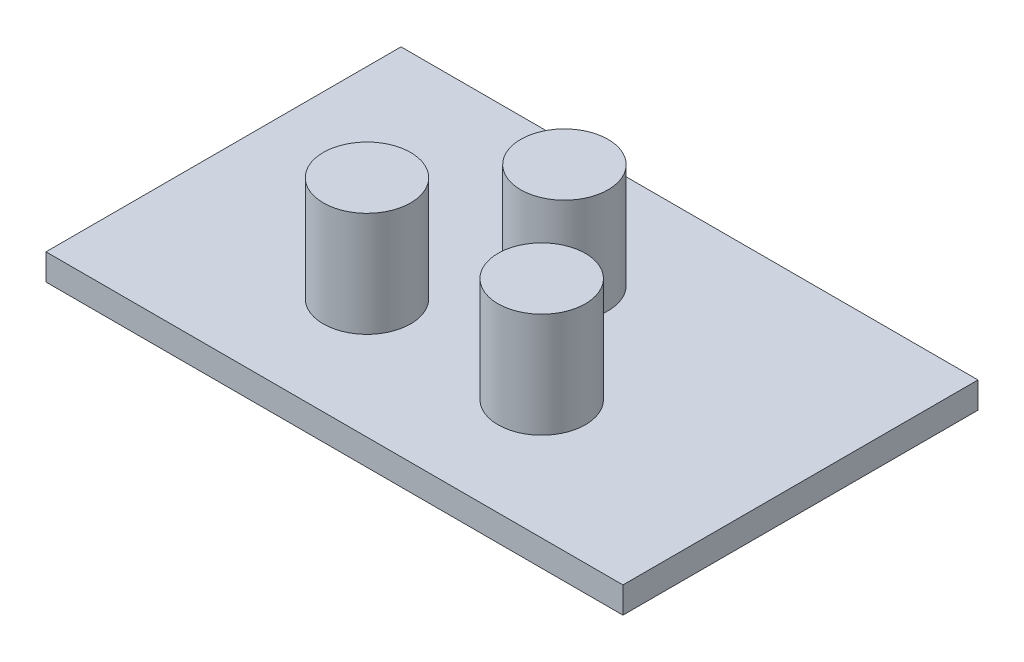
ISO-10303-21;
HEADER;
FILE_DESCRIPTION(('STEP AP214'),'2;1');
FILE_NAME('part.step','',(''),(''),'','','');
FILE_SCHEMA(('AUTOMOTIVE_DESIGN { 1 0 10303 214 1 1 1 1 }'));
ENDSEC;
DATA;
#1=APPLICATION_CONTEXT('core data for automotive mechanical design processes');
#2=APPLICATION_PROTOCOL_DEFINITION('international standard','automotive_design',2000,#1);
#3=PRODUCT_CONTEXT('',#1,'mechanical');
#4=PRODUCT('Part','Part','',(#3));
#5=PRODUCT_RELATED_PRODUCT_CATEGORY('part','',(#4));
#6=PRODUCT_DEFINITION_FORMATION('','',#4);
#7=PRODUCT_DEFINITION_CONTEXT('part definition',#1,'design');
#8=PRODUCT_DEFINITION('design','',#6,#7);
#9=PRODUCT_DEFINITION_SHAPE('','',#8);
#10=(LENGTH_UNIT() NAMED_UNIT(*) SI_UNIT(.MILLI.,.METRE.));
#11=(NAMED_UNIT(*) PLANE_ANGLE_UNIT() SI_UNIT($,.RADIAN.));
#12=(NAMED_UNIT(*) SI_UNIT($,.STERADIAN.) SOLID_ANGLE_UNIT());
#13=UNCERTAINTY_MEASURE_WITH_UNIT(LENGTH_MEASURE(1.E-05),#10,'distance_accuracy_value','');
#14=(GEOMETRIC_REPRESENTATION_CONTEXT(3) GLOBAL_UNCERTAINTY_ASSIGNED_CONTEXT((#13)) GLOBAL_UNIT_ASSIGNED_CONTEXT((#10,
#11,#12)) REPRESENTATION_CONTEXT('',''));
#15=CARTESIAN_POINT('',(0.,0.,0.));
#16=DIRECTION('',(0.,0.,1.));
#17=DIRECTION('',(1.,0.,0.));
#18=AXIS2_PLACEMENT_3D('',#15,#16,#17);
#19=CARTESIAN_POINT('',(-16.51,1.5,10.16));
#20=DIRECTION('',(1.,0.,0.));
#21=DIRECTION('',(0.,0.,-1.));
#22=AXIS2_PLACEMENT_3D('',#19,#20,#21);
#23=PLANE('',#22);
#24=DIRECTION('',(0.,0.,1.));
#25=VECTOR('',#24,1.);
#26=CARTESIAN_POINT('',(-16.51,0.,10.16));
#27=LINE('',#26,#25);
#28=CARTESIAN_POINT('',(-16.51,0.,-10.16));
#29=VERTEX_POINT('',#28);
#30=CARTESIAN_POINT('',(-16.51,0.,10.16));
#31=VERTEX_POINT('',#30);
#32=EDGE_CURVE('E119',#29,#31,#27,.T.);
#33=ORIENTED_EDGE('',*,*,#32,.T.);
#34=DIRECTION('',(0.,-1.,0.));
#35=VECTOR('',#34,1.);
#36=CARTESIAN_POINT('',(-16.51,1.5,10.16));
#37=LINE('',#36,#35);
#38=CARTESIAN_POINT('',(-16.51,1.5,10.16));
#39=VERTEX_POINT('',#38);
#40=EDGE_CURVE('E11',#39,#31,#37,.T.);
#41=ORIENTED_EDGE('',*,*,#40,.F.);
#42=DIRECTION('',(0.,0.,1.));
#43=VECTOR('',#42,1.);
#44=CARTESIAN_POINT('',(-16.51,1.5,10.16));
#45=LINE('',#44,#43);
#46=CARTESIAN_POINT('',(-16.51,1.5,-10.16));
#47=VERTEX_POINT('',#46);
#48=EDGE_CURVE('E103',#47,#39,#45,.T.);
#49=ORIENTED_EDGE('',*,*,#48,.F.);
#50=DIRECTION('',(0.,-1.,0.));
#51=VECTOR('',#50,1.);
#52=CARTESIAN_POINT('',(-16.51,1.5,-10.16));
#53=LINE('',#52,#51);
#54=EDGE_CURVE('E115',#47,#29,#53,.T.);
#55=ORIENTED_EDGE('',*,*,#54,.T.);
#56=EDGE_LOOP('',(#33,#41,#49,#55));
#57=FACE_BOUND('',#56,.T.);
#58=ADVANCED_FACE('F51',(#57),#23,.F.);
#59=CARTESIAN_POINT('',(16.51,1.5,10.16));
#60=DIRECTION('',(0.,0.,-1.));
#61=DIRECTION('',(-1.,0.,0.));
#62=AXIS2_PLACEMENT_3D('',#59,#60,#61);
#63=PLANE('',#62);
#64=DIRECTION('',(1.,0.,0.));
#65=VECTOR('',#64,1.);
#66=CARTESIAN_POINT('',(16.51,0.,10.16));
#67=LINE('',#66,#65);
#68=CARTESIAN_POINT('',(16.51,0.,10.16));
#69=VERTEX_POINT('',#68);
#70=EDGE_CURVE('E108',#31,#69,#67,.T.);
#71=ORIENTED_EDGE('',*,*,#70,.T.);
#72=DIRECTION('',(0.,-1.,0.));
#73=VECTOR('',#72,1.);
#74=CARTESIAN_POINT('',(16.51,1.5,10.16));
#75=LINE('',#74,#73);
#76=CARTESIAN_POINT('',(16.51,1.5,10.16));
#77=VERTEX_POINT('',#76);
#78=EDGE_CURVE('E60',#77,#69,#75,.T.);
#79=ORIENTED_EDGE('',*,*,#78,.F.);
#80=DIRECTION('',(1.,0.,0.));
#81=VECTOR('',#80,1.);
#82=CARTESIAN_POINT('',(16.51,1.5,10.16));
#83=LINE('',#82,#81);
#84=EDGE_CURVE('E98',#39,#77,#83,.T.);
#85=ORIENTED_EDGE('',*,*,#84,.F.);
#86=ORIENTED_EDGE('',*,*,#40,.T.);
#87=EDGE_LOOP('',(#71,#79,#85,#86));
#88=FACE_BOUND('',#87,.T.);
#89=ADVANCED_FACE('F107',(#88),#63,.F.);
#90=CARTESIAN_POINT('',(16.51,1.5,10.16));
#91=DIRECTION('',(-1.,0.,0.));
#92=DIRECTION('',(0.,0.,1.));
#93=AXIS2_PLACEMENT_3D('',#90,#91,#92);
#94=PLANE('',#93);
#95=DIRECTION('',(0.,0.,-1.));
#96=VECTOR('',#95,1.);
#97=CARTESIAN_POINT('',(16.51,0.,10.16));
#98=LINE('',#97,#96);
#99=CARTESIAN_POINT('',(16.51,0.,-10.16));
#100=VERTEX_POINT('',#99);
#101=EDGE_CURVE('E85',#69,#100,#98,.T.);
#102=ORIENTED_EDGE('',*,*,#101,.T.);
#103=DIRECTION('',(0.,-1.,0.));
#104=VECTOR('',#103,1.);
#105=CARTESIAN_POINT('',(16.51,1.5,-10.16));
#106=LINE('',#105,#104);
#107=CARTESIAN_POINT('',(16.51,1.5,-10.16));
#108=VERTEX_POINT('',#107);
#109=EDGE_CURVE('E110',#108,#100,#106,.T.);
#110=ORIENTED_EDGE('',*,*,#109,.F.);
#111=DIRECTION('',(0.,0.,-1.));
#112=VECTOR('',#111,1.);
#113=CARTESIAN_POINT('',(16.51,1.5,10.16));
#114=LINE('',#113,#112);
#115=EDGE_CURVE('E101',#77,#108,#114,.T.);
#116=ORIENTED_EDGE('',*,*,#115,.F.);
#117=ORIENTED_EDGE('',*,*,#78,.T.);
#118=EDGE_LOOP('',(#102,#110,#116,#117));
#119=FACE_BOUND('',#118,.T.);
#120=ADVANCED_FACE('F111',(#119),#94,.F.);
#121=CARTESIAN_POINT('',(16.51,1.5,-10.16));
#122=DIRECTION('',(0.,0.,1.));
#123=DIRECTION('',(1.,0.,0.));
#124=AXIS2_PLACEMENT_3D('',#121,#122,#123);
#125=PLANE('',#124);
#126=DIRECTION('',(-1.,0.,0.));
#127=VECTOR('',#126,1.);
#128=CARTESIAN_POINT('',(16.51,0.,-10.16));
#129=LINE('',#128,#127);
#130=EDGE_CURVE('E91',#100,#29,#129,.T.);
#131=ORIENTED_EDGE('',*,*,#130,.T.);
#132=ORIENTED_EDGE('',*,*,#54,.F.);
#133=DIRECTION('',(-1.,0.,0.));
#134=VECTOR('',#133,1.);
#135=CARTESIAN_POINT('',(16.51,1.5,-10.16));
#136=LINE('',#135,#134);
#137=EDGE_CURVE('E68',#108,#47,#136,.T.);
#138=ORIENTED_EDGE('',*,*,#137,.F.);
#139=ORIENTED_EDGE('',*,*,#109,.T.);
#140=EDGE_LOOP('',(#131,#132,#138,#139));
#141=FACE_BOUND('',#140,.T.);
#142=ADVANCED_FACE('F133',(#141),#125,.F.);
#143=CARTESIAN_POINT('',(0.,1.5,0.));
#144=DIRECTION('',(0.,1.,0.));
#145=DIRECTION('',(0.,0.,1.));
#146=AXIS2_PLACEMENT_3D('',#143,#144,#145);
#147=PLANE('',#146);
#148=CARTESIAN_POINT('',(5.,1.5,3.3));
#149=DIRECTION('',(0.,1.,0.));
#150=DIRECTION('',(0.,0.,1.));
#151=AXIS2_PLACEMENT_3D('',#148,#149,#150);
#152=CIRCLE('',#151,2.5);
#153=CARTESIAN_POINT('',(5.,1.5,5.8));
#154=VERTEX_POINT('',#153);
#155=EDGE_CURVE('E152',#154,#154,#152,.T.);
#156=ORIENTED_EDGE('',*,*,#155,.F.);
#157=EDGE_LOOP('',(#156));
#158=FACE_BOUND('',#157,.T.);
#159=CARTESIAN_POINT('',(-5.,1.5,3.3));
#160=DIRECTION('',(0.,1.,0.));
#161=DIRECTION('',(0.,0.,1.));
#162=AXIS2_PLACEMENT_3D('',#159,#160,#161);
#163=CIRCLE('',#162,2.5);
#164=CARTESIAN_POINT('',(-5.,1.5,5.8));
#165=VERTEX_POINT('',#164);
#166=EDGE_CURVE('E144',#165,#165,#163,.T.);
#167=ORIENTED_EDGE('',*,*,#166,.F.);
#168=EDGE_LOOP('',(#167));
#169=FACE_BOUND('',#168,.T.);
#170=CARTESIAN_POINT('',(0.,1.5,-3.));
#171=DIRECTION('',(0.,1.,0.));
#172=DIRECTION('',(0.,0.,1.));
#173=AXIS2_PLACEMENT_3D('',#170,#171,#172);
#174=CIRCLE('',#173,2.5);
#175=CARTESIAN_POINT('',(0.,1.5,-0.499999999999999));
#176=VERTEX_POINT('',#175);
#177=EDGE_CURVE('E140',#176,#176,#174,.T.);
#178=ORIENTED_EDGE('',*,*,#177,.F.);
#179=EDGE_LOOP('',(#178));
#180=FACE_BOUND('',#179,.T.);
#181=ORIENTED_EDGE('',*,*,#48,.T.);
#182=ORIENTED_EDGE('',*,*,#84,.T.);
#183=ORIENTED_EDGE('',*,*,#115,.T.);
#184=ORIENTED_EDGE('',*,*,#137,.T.);
#185=EDGE_LOOP('',(#181,#182,#183,#184));
#186=FACE_BOUND('',#185,.T.);
#187=ADVANCED_FACE('F99',(#158,#169,#180,#186),#147,.T.);
#188=CARTESIAN_POINT('',(0.,0.,0.));
#189=DIRECTION('',(0.,1.,0.));
#190=DIRECTION('',(0.,0.,1.));
#191=AXIS2_PLACEMENT_3D('',#188,#189,#190);
#192=PLANE('',#191);
#193=ORIENTED_EDGE('',*,*,#32,.F.);
#194=ORIENTED_EDGE('',*,*,#130,.F.);
#195=ORIENTED_EDGE('',*,*,#101,.F.);
#196=ORIENTED_EDGE('',*,*,#70,.F.);
#197=EDGE_LOOP('',(#193,#194,#195,#196));
#198=FACE_BOUND('',#197,.T.);
#199=ADVANCED_FACE('F136',(#198),#192,.F.);
#200=CARTESIAN_POINT('',(0.,7.5,-3.));
#201=DIRECTION('',(0.,-1.,0.));
#202=DIRECTION('',(0.,0.,-1.));
#203=AXIS2_PLACEMENT_3D('',#200,#201,#202);
#204=CYLINDRICAL_SURFACE('',#203,2.5);
#205=CARTESIAN_POINT('',(0.,7.5,-3.));
#206=DIRECTION('',(0.,1.,0.));
#207=DIRECTION('',(0.,0.,1.));
#208=AXIS2_PLACEMENT_3D('',#205,#206,#207);
#209=CIRCLE('',#208,2.5);
#210=CARTESIAN_POINT('',(0.,7.5,-0.499999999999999));
#211=VERTEX_POINT('',#210);
#212=EDGE_CURVE('E123',#211,#211,#209,.T.);
#213=ORIENTED_EDGE('',*,*,#212,.F.);
#214=EDGE_LOOP('',(#213));
#215=FACE_BOUND('',#214,.T.);
#216=ORIENTED_EDGE('',*,*,#177,.T.);
#217=EDGE_LOOP('',(#216));
#218=FACE_BOUND('',#217,.T.);
#219=ADVANCED_FACE('F173',(#215,#218),#204,.T.);
#220=CARTESIAN_POINT('',(0.,7.5,-3.));
#221=DIRECTION('',(0.,1.,0.));
#222=DIRECTION('',(0.,0.,1.));
#223=AXIS2_PLACEMENT_3D('',#220,#221,#222);
#224=PLANE('',#223);
#225=ORIENTED_EDGE('',*,*,#212,.T.);
#226=EDGE_LOOP('',(#225));
#227=FACE_BOUND('',#226,.T.);
#228=ADVANCED_FACE('F175',(#227),#224,.T.);
#229=CARTESIAN_POINT('',(-5.,7.5,3.3));
#230=DIRECTION('',(0.,-1.,0.));
#231=DIRECTION('',(0.,0.,-1.));
#232=AXIS2_PLACEMENT_3D('',#229,#230,#231);
#233=CYLINDRICAL_SURFACE('',#232,2.5);
#234=CARTESIAN_POINT('',(-5.,7.5,3.3));
#235=DIRECTION('',(0.,1.,0.));
#236=DIRECTION('',(0.,0.,1.));
#237=AXIS2_PLACEMENT_3D('',#234,#235,#236);
#238=CIRCLE('',#237,2.5);
#239=CARTESIAN_POINT('',(-5.,7.5,5.8));
#240=VERTEX_POINT('',#239);
#241=EDGE_CURVE('E148',#240,#240,#238,.T.);
#242=ORIENTED_EDGE('',*,*,#241,.F.);
#243=EDGE_LOOP('',(#242));
#244=FACE_BOUND('',#243,.T.);
#245=ORIENTED_EDGE('',*,*,#166,.T.);
#246=EDGE_LOOP('',(#245));
#247=FACE_BOUND('',#246,.T.);
#248=ADVANCED_FACE('F181',(#244,#247),#233,.T.);
#249=CARTESIAN_POINT('',(-5.,7.5,3.3));
#250=DIRECTION('',(0.,1.,0.));
#251=DIRECTION('',(0.,0.,1.));
#252=AXIS2_PLACEMENT_3D('',#249,#250,#251);
#253=PLANE('',#252);
#254=ORIENTED_EDGE('',*,*,#241,.T.);
#255=EDGE_LOOP('',(#254));
#256=FACE_BOUND('',#255,.T.);
#257=ADVANCED_FACE('F240',(#256),#253,.T.);
#258=CARTESIAN_POINT('',(5.,7.5,3.3));
#259=DIRECTION('',(0.,-1.,0.));
#260=DIRECTION('',(0.,0.,-1.));
#261=AXIS2_PLACEMENT_3D('',#258,#259,#260);
#262=CYLINDRICAL_SURFACE('',#261,2.5);
#263=CARTESIAN_POINT('',(5.,7.5,3.3));
#264=DIRECTION('',(0.,1.,0.));
#265=DIRECTION('',(0.,0.,1.));
#266=AXIS2_PLACEMENT_3D('',#263,#264,#265);
#267=CIRCLE('',#266,2.5);
#268=CARTESIAN_POINT('',(5.,7.5,5.8));
#269=VERTEX_POINT('',#268);
#270=EDGE_CURVE('E156',#269,#269,#267,.T.);
#271=ORIENTED_EDGE('',*,*,#270,.F.);
#272=EDGE_LOOP('',(#271));
#273=FACE_BOUND('',#272,.T.);
#274=ORIENTED_EDGE('',*,*,#155,.T.);
#275=EDGE_LOOP('',(#274));
#276=FACE_BOUND('',#275,.T.);
#277=ADVANCED_FACE('F164',(#273,#276),#262,.T.);
#278=CARTESIAN_POINT('',(5.,7.5,3.3));
#279=DIRECTION('',(0.,1.,0.));
#280=DIRECTION('',(0.,0.,1.));
#281=AXIS2_PLACEMENT_3D('',#278,#279,#280);
#282=PLANE('',#281);
#283=ORIENTED_EDGE('',*,*,#270,.T.);
#284=EDGE_LOOP('',(#283));
#285=FACE_BOUND('',#284,.T.);
#286=ADVANCED_FACE('F263',(#285),#282,.T.);
#287=CLOSED_SHELL('',(#58,#89,#120,#142,#187,#199,#219,#228,#248,#257,#277,#286));
#288=MANIFOLD_SOLID_BREP('B2',#287);
#289=ADVANCED_BREP_SHAPE_REPRESENTATION('',(#18,#288),#14);
#290=SHAPE_DEFINITION_REPRESENTATION(#9,#289);
ENDSEC;
END-ISO-10303-21;
